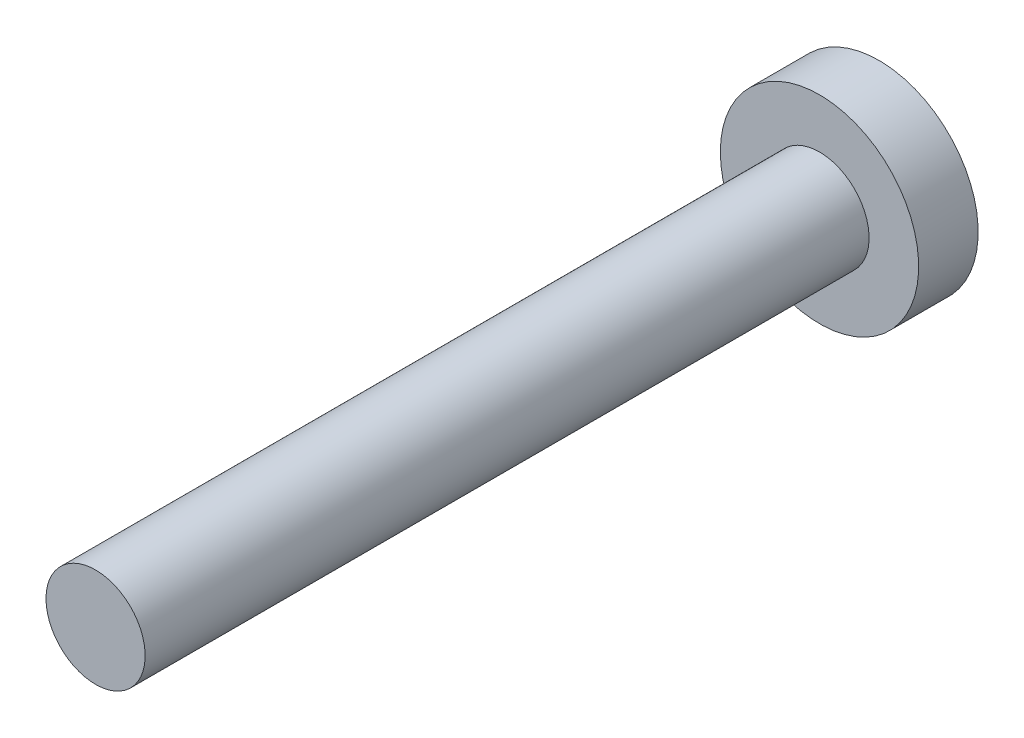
ISO-10303-21;
HEADER;
FILE_DESCRIPTION(('STEP AP214'),'2;1');
FILE_NAME('part.step','',(''),(''),'','','');
FILE_SCHEMA(('AUTOMOTIVE_DESIGN { 1 0 10303 214 1 1 1 1 }'));
ENDSEC;
DATA;
#1=APPLICATION_CONTEXT('core data for automotive mechanical design processes');
#2=APPLICATION_PROTOCOL_DEFINITION('international standard','automotive_design',2000,#1);
#3=PRODUCT_CONTEXT('',#1,'mechanical');
#4=PRODUCT('Part','Part','',(#3));
#5=PRODUCT_RELATED_PRODUCT_CATEGORY('part','',(#4));
#6=PRODUCT_DEFINITION_FORMATION('','',#4);
#7=PRODUCT_DEFINITION_CONTEXT('part definition',#1,'design');
#8=PRODUCT_DEFINITION('design','',#6,#7);
#9=PRODUCT_DEFINITION_SHAPE('','',#8);
#10=(LENGTH_UNIT() NAMED_UNIT(*) SI_UNIT(.MILLI.,.METRE.));
#11=(NAMED_UNIT(*) PLANE_ANGLE_UNIT() SI_UNIT($,.RADIAN.));
#12=(NAMED_UNIT(*) SI_UNIT($,.STERADIAN.) SOLID_ANGLE_UNIT());
#13=UNCERTAINTY_MEASURE_WITH_UNIT(LENGTH_MEASURE(1.E-05),#10,'distance_accuracy_value','');
#14=(GEOMETRIC_REPRESENTATION_CONTEXT(3) GLOBAL_UNCERTAINTY_ASSIGNED_CONTEXT((#13)) GLOBAL_UNIT_ASSIGNED_CONTEXT((#10,
#11,#12)) REPRESENTATION_CONTEXT('',''));
#15=CARTESIAN_POINT('',(0.,0.,0.));
#16=DIRECTION('',(0.,0.,1.));
#17=DIRECTION('',(1.,0.,0.));
#18=AXIS2_PLACEMENT_3D('',#15,#16,#17);
#19=CARTESIAN_POINT('',(0.,0.,3.));
#20=DIRECTION('',(0.,0.,0.999999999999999));
#21=DIRECTION('',(1.,0.,0.));
#22=AXIS2_PLACEMENT_3D('',#19,#20,#21);
#23=PLANE('',#22);
#24=CARTESIAN_POINT('',(0.,0.,3.));
#25=DIRECTION('',(0.,0.,0.999999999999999));
#26=DIRECTION('',(1.,0.,0.));
#27=AXIS2_PLACEMENT_3D('',#24,#25,#26);
#28=CIRCLE('',#27,5.);
#29=CARTESIAN_POINT('',(-4.99999999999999,0.,3.));
#30=VERTEX_POINT('',#29);
#31=EDGE_CURVE('E12',#30,#30,#28,.T.);
#32=ORIENTED_EDGE('',*,*,#31,.T.);
#33=EDGE_LOOP('',(#32));
#34=FACE_BOUND('',#33,.T.);
#35=CARTESIAN_POINT('',(0.,0.,3.));
#36=DIRECTION('',(0.,0.,0.999999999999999));
#37=DIRECTION('',(1.,0.,0.));
#38=AXIS2_PLACEMENT_3D('',#35,#36,#37);
#39=CIRCLE('',#38,2.5);
#40=CARTESIAN_POINT('',(-2.5,0.,3.));
#41=VERTEX_POINT('',#40);
#42=EDGE_CURVE('E57',#41,#41,#39,.T.);
#43=ORIENTED_EDGE('',*,*,#42,.F.);
#44=EDGE_LOOP('',(#43));
#45=FACE_BOUND('',#44,.T.);
#46=ADVANCED_FACE('F42',(#34,#45),#23,.T.);
#47=CARTESIAN_POINT('',(0.,0.,3.));
#48=DIRECTION('',(0.,0.,-0.999999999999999));
#49=DIRECTION('',(-1.,0.,0.));
#50=AXIS2_PLACEMENT_3D('',#47,#48,#49);
#51=CYLINDRICAL_SURFACE('',#50,5.);
#52=CARTESIAN_POINT('',(0.,0.,0.));
#53=DIRECTION('',(0.,0.,0.999999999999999));
#54=DIRECTION('',(1.,0.,0.));
#55=AXIS2_PLACEMENT_3D('',#52,#53,#54);
#56=CIRCLE('',#55,5.);
#57=CARTESIAN_POINT('',(-4.99999999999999,0.,0.));
#58=VERTEX_POINT('',#57);
#59=EDGE_CURVE('E49',#58,#58,#56,.T.);
#60=CARTESIAN_POINT('',(-4.99999999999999,0.,3.));
#61=CARTESIAN_POINT('',(-4.99999999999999,0.,2.96875));
#62=CARTESIAN_POINT('',(-4.99999999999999,0.,2.9375));
#63=CARTESIAN_POINT('',(-4.99999999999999,0.,2.875));
#64=CARTESIAN_POINT('',(-4.99999999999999,0.,2.84375));
#65=CARTESIAN_POINT('',(-4.99999999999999,0.,2.78125));
#66=CARTESIAN_POINT('',(-4.99999999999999,0.,2.75));
#67=CARTESIAN_POINT('',(-4.99999999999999,0.,2.6875));
#68=CARTESIAN_POINT('',(-4.99999999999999,0.,2.65625));
#69=CARTESIAN_POINT('',(-4.99999999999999,0.,2.59375));
#70=CARTESIAN_POINT('',(-4.99999999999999,0.,2.5625));
#71=CARTESIAN_POINT('',(-4.99999999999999,0.,2.5));
#72=CARTESIAN_POINT('',(-4.99999999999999,0.,2.46875));
#73=CARTESIAN_POINT('',(-4.99999999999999,0.,2.40625));
#74=CARTESIAN_POINT('',(-4.99999999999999,0.,2.375));
#75=CARTESIAN_POINT('',(-4.99999999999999,0.,2.3125));
#76=CARTESIAN_POINT('',(-4.99999999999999,0.,2.28125));
#77=CARTESIAN_POINT('',(-4.99999999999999,0.,2.21875));
#78=CARTESIAN_POINT('',(-4.99999999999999,0.,2.1875));
#79=CARTESIAN_POINT('',(-4.99999999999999,0.,2.125));
#80=CARTESIAN_POINT('',(-4.99999999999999,0.,2.09375));
#81=CARTESIAN_POINT('',(-4.99999999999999,0.,2.03125));
#82=CARTESIAN_POINT('',(-4.99999999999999,0.,2.));
#83=CARTESIAN_POINT('',(-4.99999999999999,0.,1.9375));
#84=CARTESIAN_POINT('',(-4.99999999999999,0.,1.90625));
#85=CARTESIAN_POINT('',(-4.99999999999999,0.,1.84375));
#86=CARTESIAN_POINT('',(-4.99999999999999,0.,1.8125));
#87=CARTESIAN_POINT('',(-4.99999999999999,0.,1.75));
#88=CARTESIAN_POINT('',(-4.99999999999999,0.,1.71875));
#89=CARTESIAN_POINT('',(-4.99999999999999,0.,1.65625));
#90=CARTESIAN_POINT('',(-4.99999999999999,0.,1.625));
#91=CARTESIAN_POINT('',(-4.99999999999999,0.,1.5625));
#92=CARTESIAN_POINT('',(-4.99999999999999,0.,1.53125));
#93=CARTESIAN_POINT('',(-4.99999999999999,0.,1.46875));
#94=CARTESIAN_POINT('',(-4.99999999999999,0.,1.4375));
#95=CARTESIAN_POINT('',(-4.99999999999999,0.,1.375));
#96=CARTESIAN_POINT('',(-4.99999999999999,0.,1.34375));
#97=CARTESIAN_POINT('',(-4.99999999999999,0.,1.28125));
#98=CARTESIAN_POINT('',(-4.99999999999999,0.,1.25));
#99=CARTESIAN_POINT('',(-4.99999999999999,0.,1.1875));
#100=CARTESIAN_POINT('',(-4.99999999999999,0.,1.15625));
#101=CARTESIAN_POINT('',(-4.99999999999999,0.,1.09375));
#102=CARTESIAN_POINT('',(-4.99999999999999,0.,1.0625));
#103=CARTESIAN_POINT('',(-4.99999999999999,0.,0.999999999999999));
#104=CARTESIAN_POINT('',(-4.99999999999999,0.,0.968749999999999));
#105=CARTESIAN_POINT('',(-4.99999999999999,0.,0.906249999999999));
#106=CARTESIAN_POINT('',(-4.99999999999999,0.,0.874999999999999));
#107=CARTESIAN_POINT('',(-4.99999999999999,0.,0.812499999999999));
#108=CARTESIAN_POINT('',(-4.99999999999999,0.,0.781249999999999));
#109=CARTESIAN_POINT('',(-4.99999999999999,0.,0.718749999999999));
#110=CARTESIAN_POINT('',(-4.99999999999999,0.,0.687499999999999));
#111=CARTESIAN_POINT('',(-4.99999999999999,0.,0.624999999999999));
#112=CARTESIAN_POINT('',(-4.99999999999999,0.,0.593749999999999));
#113=CARTESIAN_POINT('',(-4.99999999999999,0.,0.531249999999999));
#114=CARTESIAN_POINT('',(-4.99999999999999,0.,0.499999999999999));
#115=CARTESIAN_POINT('',(-4.99999999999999,0.,0.4375));
#116=CARTESIAN_POINT('',(-4.99999999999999,0.,0.40625));
#117=CARTESIAN_POINT('',(-4.99999999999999,0.,0.343749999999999));
#118=CARTESIAN_POINT('',(-4.99999999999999,0.,0.312499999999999));
#119=CARTESIAN_POINT('',(-4.99999999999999,0.,0.249999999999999));
#120=CARTESIAN_POINT('',(-4.99999999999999,0.,0.218749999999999));
#121=CARTESIAN_POINT('',(-4.99999999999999,0.,0.156249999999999));
#122=CARTESIAN_POINT('',(-4.99999999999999,0.,0.124999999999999));
#123=CARTESIAN_POINT('',(-4.99999999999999,0.,0.0624999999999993));
#124=CARTESIAN_POINT('',(-4.99999999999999,0.,0.0312499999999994));
#125=CARTESIAN_POINT('',(-4.99999999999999,0.,0.));
#126=B_SPLINE_CURVE_WITH_KNOTS('',3,(#60,#61,#62,#63,#64,#65,#66,#67,#68,#69,#70,#71,#72,#73,
#74,#75,#76,#77,#78,#79,#80,#81,#82,#83,#84,#85,#86,#87,#88,#89,#90,#91,#92,#93,#94,#95,#96,#97,
#98,#99,#100,#101,#102,#103,#104,#105,#106,#107,#108,#109,#110,#111,#112,#113,#114,#115,#116,
#117,#118,#119,#120,#121,#122,#123,#124,#125),.UNSPECIFIED.,.F.,.F.,(4,2,2,2,2,2,2,2,2,2,2,2,2,
2,2,2,2,2,2,2,2,2,2,2,2,2,2,2,2,2,2,2,4),(0.,0.0937499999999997,0.1875,0.28125,0.375,0.46875,
0.5625,0.65625,0.749999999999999,0.843749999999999,0.9375,1.03125,1.125,1.21875,1.3125,1.40625,
1.5,1.59375,1.6875,1.78125,1.875,1.96875,2.0625,2.15625,2.25,2.34375,2.4375,2.53125,2.625,
2.71875,2.8125,2.90625,3.),.UNSPECIFIED.);
#127=EDGE_CURVE('BSEAM44',#30,#58,#126,.T.);
#128=ORIENTED_EDGE('',*,*,#31,.F.);
#129=ORIENTED_EDGE('',*,*,#59,.T.);
#130=ORIENTED_EDGE('',*,*,#127,.T.);
#131=ORIENTED_EDGE('',*,*,#127,.F.);
#132=EDGE_LOOP('',(#128,#130,#129,#131));
#133=FACE_BOUND('',#132,.T.);
#134=ADVANCED_FACE('F44',(#133),#51,.T.);
#135=CARTESIAN_POINT('',(0.,0.,0.));
#136=DIRECTION('',(0.,0.,0.999999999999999));
#137=DIRECTION('',(1.,0.,0.));
#138=AXIS2_PLACEMENT_3D('',#135,#136,#137);
#139=PLANE('',#138);
#140=ORIENTED_EDGE('',*,*,#59,.F.);
#141=EDGE_LOOP('',(#140));
#142=FACE_BOUND('',#141,.T.);
#143=ADVANCED_FACE('F69',(#142),#139,.F.);
#144=CARTESIAN_POINT('',(0.,0.,39.5));
#145=DIRECTION('',(0.,0.,-0.999999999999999));
#146=DIRECTION('',(-1.,0.,0.));
#147=AXIS2_PLACEMENT_3D('',#144,#145,#146);
#148=CYLINDRICAL_SURFACE('',#147,2.5);
#149=CARTESIAN_POINT('',(0.,0.,39.5));
#150=DIRECTION('',(0.,0.,0.999999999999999));
#151=DIRECTION('',(1.,0.,0.));
#152=AXIS2_PLACEMENT_3D('',#149,#150,#151);
#153=CIRCLE('',#152,2.5);
#154=CARTESIAN_POINT('',(-2.5,0.,39.5));
#155=VERTEX_POINT('',#154);
#156=EDGE_CURVE('E53',#155,#155,#153,.T.);
#157=CARTESIAN_POINT('',(-2.5,0.,39.5));
#158=CARTESIAN_POINT('',(-2.5,0.,39.1197916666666));
#159=CARTESIAN_POINT('',(-2.5,0.,38.7395833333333));
#160=CARTESIAN_POINT('',(-2.5,0.,37.9791666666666));
#161=CARTESIAN_POINT('',(-2.5,0.,37.5989583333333));
#162=CARTESIAN_POINT('',(-2.5,0.,36.8385416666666));
#163=CARTESIAN_POINT('',(-2.5,0.,36.4583333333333));
#164=CARTESIAN_POINT('',(-2.5,0.,35.6979166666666));
#165=CARTESIAN_POINT('',(-2.5,0.,35.3177083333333));
#166=CARTESIAN_POINT('',(-2.5,0.,34.5572916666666));
#167=CARTESIAN_POINT('',(-2.5,0.,34.1770833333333));
#168=CARTESIAN_POINT('',(-2.5,0.,33.4166666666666));
#169=CARTESIAN_POINT('',(-2.5,0.,33.0364583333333));
#170=CARTESIAN_POINT('',(-2.5,0.,32.2760416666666));
#171=CARTESIAN_POINT('',(-2.5,0.,31.8958333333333));
#172=CARTESIAN_POINT('',(-2.5,0.,31.1354166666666));
#173=CARTESIAN_POINT('',(-2.5,0.,30.7552083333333));
#174=CARTESIAN_POINT('',(-2.5,0.,29.9947916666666));
#175=CARTESIAN_POINT('',(-2.5,0.,29.6145833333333));
#176=CARTESIAN_POINT('',(-2.5,0.,28.8541666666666));
#177=CARTESIAN_POINT('',(-2.5,0.,28.4739583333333));
#178=CARTESIAN_POINT('',(-2.5,0.,27.7135416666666));
#179=CARTESIAN_POINT('',(-2.5,0.,27.3333333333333));
#180=CARTESIAN_POINT('',(-2.5,0.,26.5729166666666));
#181=CARTESIAN_POINT('',(-2.5,0.,26.1927083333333));
#182=CARTESIAN_POINT('',(-2.5,0.,25.4322916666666));
#183=CARTESIAN_POINT('',(-2.5,0.,25.0520833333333));
#184=CARTESIAN_POINT('',(-2.5,0.,24.2916666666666));
#185=CARTESIAN_POINT('',(-2.5,0.,23.9114583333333));
#186=CARTESIAN_POINT('',(-2.5,0.,23.1510416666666));
#187=CARTESIAN_POINT('',(-2.5,0.,22.7708333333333));
#188=CARTESIAN_POINT('',(-2.5,0.,22.0104166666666));
#189=CARTESIAN_POINT('',(-2.5,0.,21.6302083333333));
#190=CARTESIAN_POINT('',(-2.5,0.,20.8697916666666));
#191=CARTESIAN_POINT('',(-2.5,0.,20.4895833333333));
#192=CARTESIAN_POINT('',(-2.5,0.,19.7291666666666));
#193=CARTESIAN_POINT('',(-2.5,0.,19.3489583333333));
#194=CARTESIAN_POINT('',(-2.5,0.,18.5885416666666));
#195=CARTESIAN_POINT('',(-2.5,0.,18.2083333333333));
#196=CARTESIAN_POINT('',(-2.5,0.,17.4479166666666));
#197=CARTESIAN_POINT('',(-2.5,0.,17.0677083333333));
#198=CARTESIAN_POINT('',(-2.5,0.,16.3072916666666));
#199=CARTESIAN_POINT('',(-2.5,0.,15.9270833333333));
#200=CARTESIAN_POINT('',(-2.5,0.,15.1666666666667));
#201=CARTESIAN_POINT('',(-2.5,0.,14.7864583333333));
#202=CARTESIAN_POINT('',(-2.5,0.,14.0260416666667));
#203=CARTESIAN_POINT('',(-2.5,0.,13.6458333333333));
#204=CARTESIAN_POINT('',(-2.5,0.,12.8854166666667));
#205=CARTESIAN_POINT('',(-2.5,0.,12.5052083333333));
#206=CARTESIAN_POINT('',(-2.5,0.,11.7447916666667));
#207=CARTESIAN_POINT('',(-2.5,0.,11.3645833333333));
#208=CARTESIAN_POINT('',(-2.5,0.,10.6041666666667));
#209=CARTESIAN_POINT('',(-2.5,0.,10.2239583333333));
#210=CARTESIAN_POINT('',(-2.5,0.,9.46354166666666));
#211=CARTESIAN_POINT('',(-2.5,0.,9.08333333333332));
#212=CARTESIAN_POINT('',(-2.5,0.,8.32291666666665));
#213=CARTESIAN_POINT('',(-2.5,0.,7.94270833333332));
#214=CARTESIAN_POINT('',(-2.5,0.,7.18229166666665));
#215=CARTESIAN_POINT('',(-2.5,0.,6.80208333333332));
#216=CARTESIAN_POINT('',(-2.5,0.,6.04166666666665));
#217=CARTESIAN_POINT('',(-2.5,0.,5.66145833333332));
#218=CARTESIAN_POINT('',(-2.5,0.,4.90104166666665));
#219=CARTESIAN_POINT('',(-2.5,0.,4.52083333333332));
#220=CARTESIAN_POINT('',(-2.5,0.,3.76041666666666));
#221=CARTESIAN_POINT('',(-2.5,0.,3.38020833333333));
#222=CARTESIAN_POINT('',(-2.5,0.,3.));
#223=B_SPLINE_CURVE_WITH_KNOTS('',3,(#157,#158,#159,#160,#161,#162,#163,#164,#165,#166,#167,
#168,#169,#170,#171,#172,#173,#174,#175,#176,#177,#178,#179,#180,#181,#182,#183,#184,#185,#186,
#187,#188,#189,#190,#191,#192,#193,#194,#195,#196,#197,#198,#199,#200,#201,#202,#203,#204,#205,
#206,#207,#208,#209,#210,#211,#212,#213,#214,#215,#216,#217,#218,#219,#220,#221,#222),
.UNSPECIFIED.,.F.,.F.,(4,2,2,2,2,2,2,2,2,2,2,2,2,2,2,2,2,2,2,2,2,2,2,2,2,2,2,2,2,2,2,2,4),(0.,
1.14062499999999,2.28124999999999,3.42187499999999,4.56249999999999,5.70312499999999,
6.84374999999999,7.98437499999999,9.12499999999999,10.265625,11.40625,12.546875,13.6875,
14.828125,15.96875,17.109375,18.25,19.390625,20.53125,21.671875,22.8125,23.953125,25.09375,
26.234375,27.375,28.515625,29.65625,30.796875,31.9375,33.078125,34.21875,35.359375,36.5),.UNSPECIFIED.);
#224=EDGE_CURVE('BSEAM63',#155,#41,#223,.T.);
#225=ORIENTED_EDGE('',*,*,#156,.F.);
#226=ORIENTED_EDGE('',*,*,#42,.T.);
#227=ORIENTED_EDGE('',*,*,#224,.T.);
#228=ORIENTED_EDGE('',*,*,#224,.F.);
#229=EDGE_LOOP('',(#225,#227,#226,#228));
#230=FACE_BOUND('',#229,.T.);
#231=ADVANCED_FACE('F63',(#230),#148,.T.);
#232=CARTESIAN_POINT('',(0.,0.,39.5));
#233=DIRECTION('',(0.,0.,0.999999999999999));
#234=DIRECTION('',(1.,0.,0.));
#235=AXIS2_PLACEMENT_3D('',#232,#233,#234);
#236=PLANE('',#235);
#237=ORIENTED_EDGE('',*,*,#156,.T.);
#238=EDGE_LOOP('',(#237));
#239=FACE_BOUND('',#238,.T.);
#240=ADVANCED_FACE('F77',(#239),#236,.T.);
#241=CLOSED_SHELL('',(#46,#134,#143,#231,#240));
#242=MANIFOLD_SOLID_BREP('B2',#241);
#243=ADVANCED_BREP_SHAPE_REPRESENTATION('',(#18,#242),#14);
#244=SHAPE_DEFINITION_REPRESENTATION(#9,#243);
ENDSEC;
END-ISO-10303-21;
